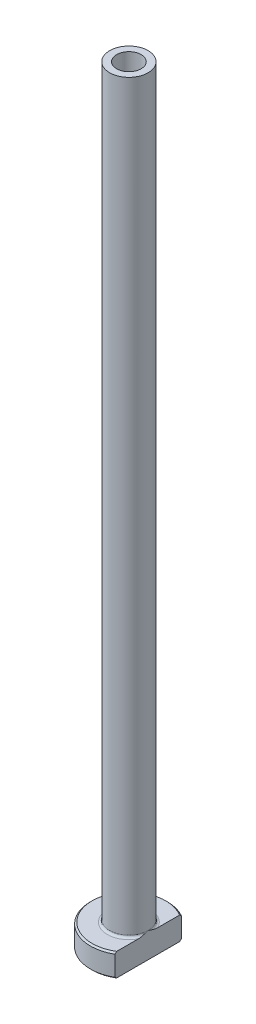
from build123d import *

# Parameters (mm, degrees)
FILLET1_R          = 0.3
CHAMFER1_SIZE      = 0.2
CUT_EXTRUDE1_DEPTH = 101.249688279
CHAMFER2_SIZE      = 0.5


with BuildPart() as part:
    # Sketch1 → Revolve1 (revolve)
    with BuildSketch(Plane.XY, mode=Mode.PRIVATE) as revolve1_sk:
        Polygon((-1.6, 100), (-2.5, 100), (-2.5, 3), (-5, 3), (-5, 0), (-1.85, 0), (-1.85, 43), (-1.6, 55), align=None)
    revolve(revolve1_sk.sketch.rotate(Axis((0, 92.187680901, 0), (0, -1, 0)), 270), axis=Axis((0, 92.187680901, 0), (0, -1, 0)))

    # Fillet1
    fillet1_edges = [part.edges().sort_by_distance(p)[0] for p in [
        (0, 3, -2.5),
    ]]
    fillet(fillet1_edges, radius=FILLET1_R)

    # Chamfer1
    chamfer1_edges = [part.edges().sort_by_distance(p)[0] for p in [
        (0, 0, -5),
        (0, 3, -5),
    ]]
    chamfer(chamfer1_edges, length=CHAMFER1_SIZE)

    # Sketch2 → Cut-Extrude1 (cut, through all)
    with BuildSketch(Plane.XZ):
        with BuildLine():
            Line((2.5, 4.330127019), (2.5, -4.330127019))
            ThreePointArc((2.5, -4.330127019), (5, 0), (2.5, 4.330127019))
        make_face()
    extrude(amount=-CUT_EXTRUDE1_DEPTH, mode=Mode.SUBTRACT)

    # Chamfer2
    chamfer2_edges = [part.edges().sort_by_distance(p)[0] for p in [
        (0, 0, -1.85),
    ]]
    chamfer(chamfer2_edges, length=CHAMFER2_SIZE)


solid = part.part
